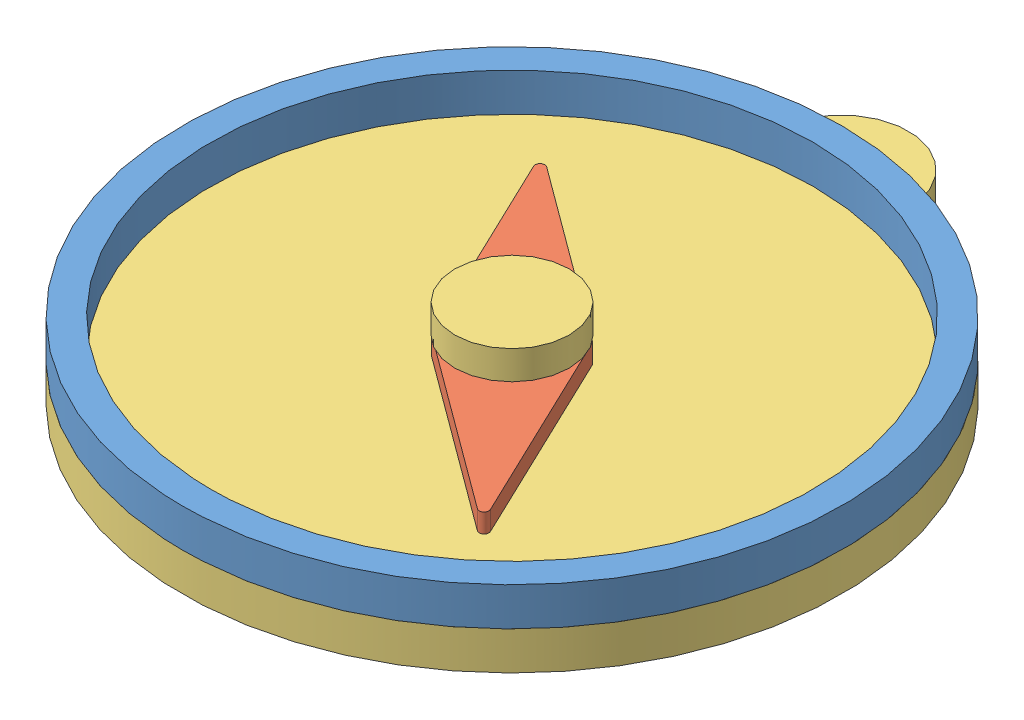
SolidWorks assembly Compass.SLDASM, configuration Default (file format 14000). Lengths in mm.
Overall size (69 9.25 76).
3 component instances, 3 part files, 2 mates.
Components (placement in the parent):
- Compass Rim-1: Compass Rim.SLDPRT [Default] at origin size (69 4 69)
- Compass Arrow-1: Compass Arrow.SLDPRT [Default] x (-0.770646 0 0.637264) z (-0.637264 0 -0.770646) size (12 2 44.88)
- Compass Base-1: Compass Base.SLDPRT [Default] at origin size (69 9.25 76)
Mates (geometry in assembly coordinates):
- Concentric1: concentric aligned: cylinder of Compass Arrow-1 through (0 6 0) axis (0 -1 0) radius 2; cylinder of Compass Base-1 through (0 6.25 0) axis (0 -1 0) radius 1.625
- Coincident1: coincident anti-aligned: plane of Compass Arrow-1 through (0 4 0) normal (0 -1 0); plane of Compass Base-1 through (0 4 -17.25) normal (0 1 0)
